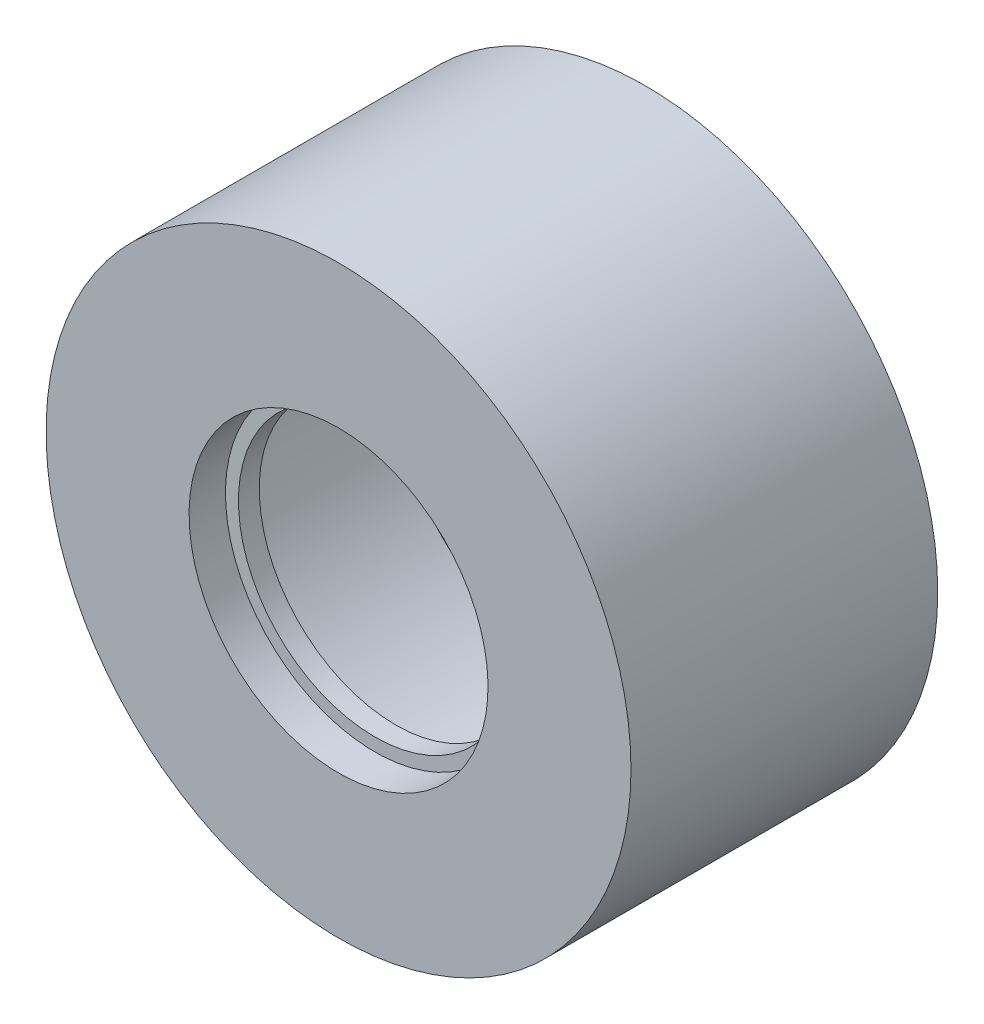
ISO-10303-21;
HEADER;
FILE_DESCRIPTION(('STEP AP214'),'2;1');
FILE_NAME('part.step','',(''),(''),'','','');
FILE_SCHEMA(('AUTOMOTIVE_DESIGN { 1 0 10303 214 1 1 1 1 }'));
ENDSEC;
DATA;
#1=APPLICATION_CONTEXT('core data for automotive mechanical design processes');
#2=APPLICATION_PROTOCOL_DEFINITION('international standard','automotive_design',2000,#1);
#3=PRODUCT_CONTEXT('',#1,'mechanical');
#4=PRODUCT('Part','Part','',(#3));
#5=PRODUCT_RELATED_PRODUCT_CATEGORY('part','',(#4));
#6=PRODUCT_DEFINITION_FORMATION('','',#4);
#7=PRODUCT_DEFINITION_CONTEXT('part definition',#1,'design');
#8=PRODUCT_DEFINITION('design','',#6,#7);
#9=PRODUCT_DEFINITION_SHAPE('','',#8);
#10=(LENGTH_UNIT() NAMED_UNIT(*) SI_UNIT(.MILLI.,.METRE.));
#11=(NAMED_UNIT(*) PLANE_ANGLE_UNIT() SI_UNIT($,.RADIAN.));
#12=(NAMED_UNIT(*) SI_UNIT($,.STERADIAN.) SOLID_ANGLE_UNIT());
#13=UNCERTAINTY_MEASURE_WITH_UNIT(LENGTH_MEASURE(1.E-05),#10,'distance_accuracy_value','');
#14=(GEOMETRIC_REPRESENTATION_CONTEXT(3) GLOBAL_UNCERTAINTY_ASSIGNED_CONTEXT((#13)) GLOBAL_UNIT_ASSIGNED_CONTEXT((#10,
#11,#12)) REPRESENTATION_CONTEXT('',''));
#15=CARTESIAN_POINT('',(0.,0.,0.));
#16=DIRECTION('',(0.,0.,1.));
#17=DIRECTION('',(1.,0.,0.));
#18=AXIS2_PLACEMENT_3D('',#15,#16,#17);
#19=CARTESIAN_POINT('',(11.6645470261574,314.986407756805,78.7368326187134));
#20=DIRECTION('',(0.,0.,1.));
#21=DIRECTION('',(-1.,0.,0.));
#22=AXIS2_PLACEMENT_3D('',#19,#20,#21);
#23=PLANE('',#22);
#24=CARTESIAN_POINT('',(-195.710442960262,107.611417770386,78.7368326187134));
#25=DIRECTION('',(0.,0.,1.));
#26=DIRECTION('',(1.,0.,0.));
#27=AXIS2_PLACEMENT_3D('',#24,#25,#26);
#28=CIRCLE('',#27,115.);
#29=CARTESIAN_POINT('',(-195.710442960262,-7.38858222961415,78.7368326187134));
#30=VERTEX_POINT('',#29);
#31=EDGE_CURVE('E18',#30,#30,#28,.T.);
#32=ORIENTED_EDGE('',*,*,#31,.F.);
#33=EDGE_LOOP('',(#32));
#34=FACE_BOUND('',#33,.T.);
#35=CARTESIAN_POINT('',(-195.710442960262,107.611417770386,78.7368326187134));
#36=DIRECTION('',(0.,0.,1.));
#37=DIRECTION('',(0.,-1.,0.));
#38=AXIS2_PLACEMENT_3D('',#35,#36,#37);
#39=CIRCLE('',#38,197.5);
#40=CARTESIAN_POINT('',(1.78955703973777,107.611417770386,78.7368326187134));
#41=VERTEX_POINT('',#40);
#42=EDGE_CURVE('E9',#41,#41,#39,.T.);
#43=ORIENTED_EDGE('',*,*,#42,.T.);
#44=EDGE_LOOP('',(#43));
#45=FACE_BOUND('',#44,.T.);
#46=ADVANCED_FACE('F14',(#34,#45),#23,.T.);
#47=CARTESIAN_POINT('',(-195.710442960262,107.611417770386,255.236832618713));
#48=DIRECTION('',(0.,0.,-1.));
#49=DIRECTION('',(-1.,0.,0.));
#50=AXIS2_PLACEMENT_3D('',#47,#48,#49);
#51=CYLINDRICAL_SURFACE('',#50,197.5);
#52=CARTESIAN_POINT('',(-195.710442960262,107.611417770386,255.236832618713));
#53=DIRECTION('',(0.,0.,-1.));
#54=DIRECTION('',(-1.,0.,0.));
#55=AXIS2_PLACEMENT_3D('',#52,#53,#54);
#56=CIRCLE('',#55,197.5);
#57=CARTESIAN_POINT('',(1.78955703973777,107.611417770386,255.236832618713));
#58=VERTEX_POINT('',#57);
#59=EDGE_CURVE('E130',#58,#58,#56,.T.);
#60=ORIENTED_EDGE('',*,*,#59,.F.);
#61=DIRECTION('',(0.,0.,1.));
#62=VECTOR('',#61,1.);
#63=CARTESIAN_POINT('',(1.78955703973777,107.611417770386,166.986832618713));
#64=LINE('',#63,#62);
#65=EDGE_CURVE('E24',#41,#58,#64,.T.);
#66=ORIENTED_EDGE('',*,*,#65,.F.);
#67=ORIENTED_EDGE('',*,*,#42,.F.);
#68=ORIENTED_EDGE('',*,*,#65,.T.);
#69=EDGE_LOOP('',(#60,#66,#67,#68));
#70=FACE_BOUND('',#69,.T.);
#71=ADVANCED_FACE('F105',(#70),#51,.F.);
#72=CARTESIAN_POINT('',(-403.085432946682,-99.7635722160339,255.236832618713));
#73=DIRECTION('',(0.,0.,-1.));
#74=DIRECTION('',(0.,1.,0.));
#75=AXIS2_PLACEMENT_3D('',#72,#73,#74);
#76=PLANE('',#75);
#77=CARTESIAN_POINT('',(-195.710442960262,107.611417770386,255.236832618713));
#78=DIRECTION('',(0.,0.,1.));
#79=DIRECTION('',(1.,0.,0.));
#80=AXIS2_PLACEMENT_3D('',#77,#78,#79);
#81=CIRCLE('',#80,105.);
#82=CARTESIAN_POINT('',(-195.710442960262,212.611417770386,255.236832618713));
#83=VERTEX_POINT('',#82);
#84=EDGE_CURVE('E133',#83,#83,#81,.T.);
#85=ORIENTED_EDGE('',*,*,#84,.T.);
#86=EDGE_LOOP('',(#85));
#87=FACE_BOUND('',#86,.T.);
#88=ORIENTED_EDGE('',*,*,#59,.T.);
#89=EDGE_LOOP('',(#88));
#90=FACE_BOUND('',#89,.T.);
#91=ADVANCED_FACE('F110',(#87,#90),#76,.T.);
#92=CARTESIAN_POINT('',(-195.710442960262,107.611417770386,271.236832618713));
#93=DIRECTION('',(0.,0.,-1.));
#94=DIRECTION('',(-1.,0.,0.));
#95=AXIS2_PLACEMENT_3D('',#92,#93,#94);
#96=CYLINDRICAL_SURFACE('',#95,105.);
#97=CARTESIAN_POINT('',(-195.710442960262,107.611417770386,271.236832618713));
#98=DIRECTION('',(0.,0.,1.));
#99=DIRECTION('',(1.,0.,0.));
#100=AXIS2_PLACEMENT_3D('',#97,#98,#99);
#101=CIRCLE('',#100,105.);
#102=CARTESIAN_POINT('',(-195.710442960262,212.611417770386,271.236832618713));
#103=VERTEX_POINT('',#102);
#104=EDGE_CURVE('E129',#103,#103,#101,.T.);
#105=ORIENTED_EDGE('',*,*,#104,.T.);
#106=DIRECTION('',(0.,0.,1.));
#107=VECTOR('',#106,1.);
#108=CARTESIAN_POINT('',(-195.710442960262,212.611417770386,263.236832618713));
#109=LINE('',#108,#107);
#110=EDGE_CURVE('E64',#83,#103,#109,.T.);
#111=ORIENTED_EDGE('',*,*,#110,.F.);
#112=ORIENTED_EDGE('',*,*,#84,.F.);
#113=ORIENTED_EDGE('',*,*,#110,.T.);
#114=EDGE_LOOP('',(#105,#111,#112,#113));
#115=FACE_BOUND('',#114,.T.);
#116=ADVANCED_FACE('F117',(#115),#96,.F.);
#117=CARTESIAN_POINT('',(-316.460438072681,-13.1385773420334,271.236832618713));
#118=DIRECTION('',(0.,0.,1.));
#119=DIRECTION('',(1.,0.,0.));
#120=AXIS2_PLACEMENT_3D('',#117,#118,#119);
#121=PLANE('',#120);
#122=ORIENTED_EDGE('',*,*,#104,.F.);
#123=EDGE_LOOP('',(#122));
#124=FACE_BOUND('',#123,.T.);
#125=CARTESIAN_POINT('',(-195.710442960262,107.611417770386,271.236832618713));
#126=DIRECTION('',(0.,0.,1.));
#127=DIRECTION('',(1.,0.,0.));
#128=AXIS2_PLACEMENT_3D('',#125,#126,#127);
#129=CIRCLE('',#128,115.);
#130=CARTESIAN_POINT('',(-195.710442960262,222.611417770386,271.236832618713));
#131=VERTEX_POINT('',#130);
#132=EDGE_CURVE('E60',#131,#131,#129,.T.);
#133=ORIENTED_EDGE('',*,*,#132,.T.);
#134=EDGE_LOOP('',(#133));
#135=FACE_BOUND('',#134,.T.);
#136=ADVANCED_FACE('F102',(#124,#135),#121,.T.);
#137=CARTESIAN_POINT('',(-195.710442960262,107.611417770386,299.236832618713));
#138=DIRECTION('',(0.,0.,-1.));
#139=DIRECTION('',(-1.,0.,0.));
#140=AXIS2_PLACEMENT_3D('',#137,#138,#139);
#141=CYLINDRICAL_SURFACE('',#140,115.);
#142=CARTESIAN_POINT('',(-195.710442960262,107.611417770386,299.236832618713));
#143=DIRECTION('',(0.,0.,-1.));
#144=DIRECTION('',(-1.,0.,0.));
#145=AXIS2_PLACEMENT_3D('',#142,#143,#144);
#146=CIRCLE('',#145,115.);
#147=CARTESIAN_POINT('',(-195.710442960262,222.611417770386,299.236832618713));
#148=VERTEX_POINT('',#147);
#149=EDGE_CURVE('E62',#148,#148,#146,.T.);
#150=ORIENTED_EDGE('',*,*,#149,.F.);
#151=DIRECTION('',(0.,0.,-1.));
#152=VECTOR('',#151,1.);
#153=CARTESIAN_POINT('',(-195.710442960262,222.611417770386,285.236832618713));
#154=LINE('',#153,#152);
#155=EDGE_CURVE('E57',#148,#131,#154,.T.);
#156=ORIENTED_EDGE('',*,*,#155,.T.);
#157=ORIENTED_EDGE('',*,*,#132,.F.);
#158=ORIENTED_EDGE('',*,*,#155,.F.);
#159=EDGE_LOOP('',(#150,#156,#157,#158));
#160=FACE_BOUND('',#159,.T.);
#161=ADVANCED_FACE('F58',(#160),#141,.F.);
#162=CARTESIAN_POINT('',(40.5395403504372,-128.638565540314,299.236832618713));
#163=DIRECTION('',(0.,0.,1.));
#164=DIRECTION('',(0.,1.,0.));
#165=AXIS2_PLACEMENT_3D('',#162,#163,#164);
#166=PLANE('',#165);
#167=ORIENTED_EDGE('',*,*,#149,.T.);
#168=EDGE_LOOP('',(#167));
#169=FACE_BOUND('',#168,.T.);
#170=CARTESIAN_POINT('',(-195.710442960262,107.611417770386,299.236832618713));
#171=DIRECTION('',(0.,0.,-1.));
#172=DIRECTION('',(0.,1.,0.));
#173=AXIS2_PLACEMENT_3D('',#170,#171,#172);
#174=CIRCLE('',#173,225.);
#175=CARTESIAN_POINT('',(29.2895570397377,107.611417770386,299.236832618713));
#176=VERTEX_POINT('',#175);
#177=EDGE_CURVE('E72',#176,#176,#174,.T.);
#178=ORIENTED_EDGE('',*,*,#177,.F.);
#179=EDGE_LOOP('',(#178));
#180=FACE_BOUND('',#179,.T.);
#181=ADVANCED_FACE('F92',(#169,#180),#166,.T.);
#182=CARTESIAN_POINT('',(-195.710442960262,107.611417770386,63.2368326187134));
#183=DIRECTION('',(0.,0.,1.));
#184=DIRECTION('',(1.,0.,0.));
#185=AXIS2_PLACEMENT_3D('',#182,#183,#184);
#186=CYLINDRICAL_SURFACE('',#185,225.);
#187=CARTESIAN_POINT('',(-195.710442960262,107.611417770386,63.2368326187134));
#188=DIRECTION('',(0.,0.,1.));
#189=DIRECTION('',(1.,0.,0.));
#190=AXIS2_PLACEMENT_3D('',#187,#188,#189);
#191=CIRCLE('',#190,225.);
#192=CARTESIAN_POINT('',(29.2895570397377,107.611417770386,63.2368326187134));
#193=VERTEX_POINT('',#192);
#194=EDGE_CURVE('E66',#193,#193,#191,.T.);
#195=ORIENTED_EDGE('',*,*,#194,.T.);
#196=DIRECTION('',(0.,0.,-1.));
#197=VECTOR('',#196,1.);
#198=CARTESIAN_POINT('',(29.2895570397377,107.611417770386,181.236832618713));
#199=LINE('',#198,#197);
#200=EDGE_CURVE('E75',#176,#193,#199,.T.);
#201=ORIENTED_EDGE('',*,*,#200,.F.);
#202=ORIENTED_EDGE('',*,*,#177,.T.);
#203=ORIENTED_EDGE('',*,*,#200,.T.);
#204=EDGE_LOOP('',(#195,#201,#202,#203));
#205=FACE_BOUND('',#204,.T.);
#206=ADVANCED_FACE('F87',(#205),#186,.T.);
#207=CARTESIAN_POINT('',(-431.960426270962,343.861401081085,63.2368326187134));
#208=DIRECTION('',(0.,0.,-1.));
#209=DIRECTION('',(1.,0.,0.));
#210=AXIS2_PLACEMENT_3D('',#207,#208,#209);
#211=PLANE('',#210);
#212=CARTESIAN_POINT('',(-195.710442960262,107.611417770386,63.2368326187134));
#213=DIRECTION('',(0.,0.,1.));
#214=DIRECTION('',(1.,0.,0.));
#215=AXIS2_PLACEMENT_3D('',#212,#213,#214);
#216=CIRCLE('',#215,115.);
#217=CARTESIAN_POINT('',(-195.710442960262,-7.38858222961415,63.2368326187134));
#218=VERTEX_POINT('',#217);
#219=EDGE_CURVE('E77',#218,#218,#216,.T.);
#220=ORIENTED_EDGE('',*,*,#219,.T.);
#221=EDGE_LOOP('',(#220));
#222=FACE_BOUND('',#221,.T.);
#223=ORIENTED_EDGE('',*,*,#194,.F.);
#224=EDGE_LOOP('',(#223));
#225=FACE_BOUND('',#224,.T.);
#226=ADVANCED_FACE('F84',(#222,#225),#211,.T.);
#227=CARTESIAN_POINT('',(-195.710442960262,107.611417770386,78.7368326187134));
#228=DIRECTION('',(0.,0.,-1.));
#229=DIRECTION('',(-1.,0.,0.));
#230=AXIS2_PLACEMENT_3D('',#227,#228,#229);
#231=CYLINDRICAL_SURFACE('',#230,115.);
#232=ORIENTED_EDGE('',*,*,#219,.F.);
#233=DIRECTION('',(0.,0.,1.));
#234=VECTOR('',#233,1.);
#235=CARTESIAN_POINT('',(-195.710442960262,-7.38858222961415,70.9868326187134));
#236=LINE('',#235,#234);
#237=EDGE_CURVE('E79',#218,#30,#236,.T.);
#238=ORIENTED_EDGE('',*,*,#237,.T.);
#239=ORIENTED_EDGE('',*,*,#31,.T.);
#240=ORIENTED_EDGE('',*,*,#237,.F.);
#241=EDGE_LOOP('',(#232,#238,#239,#240));
#242=FACE_BOUND('',#241,.T.);
#243=ADVANCED_FACE('F16',(#242),#231,.F.);
#244=CLOSED_SHELL('',(#46,#71,#91,#116,#136,#161,#181,#206,#226,#243));
#245=MANIFOLD_SOLID_BREP('B1',#244);
#246=ADVANCED_BREP_SHAPE_REPRESENTATION('',(#18,#245),#14);
#247=SHAPE_DEFINITION_REPRESENTATION(#9,#246);
ENDSEC;
END-ISO-10303-21;
